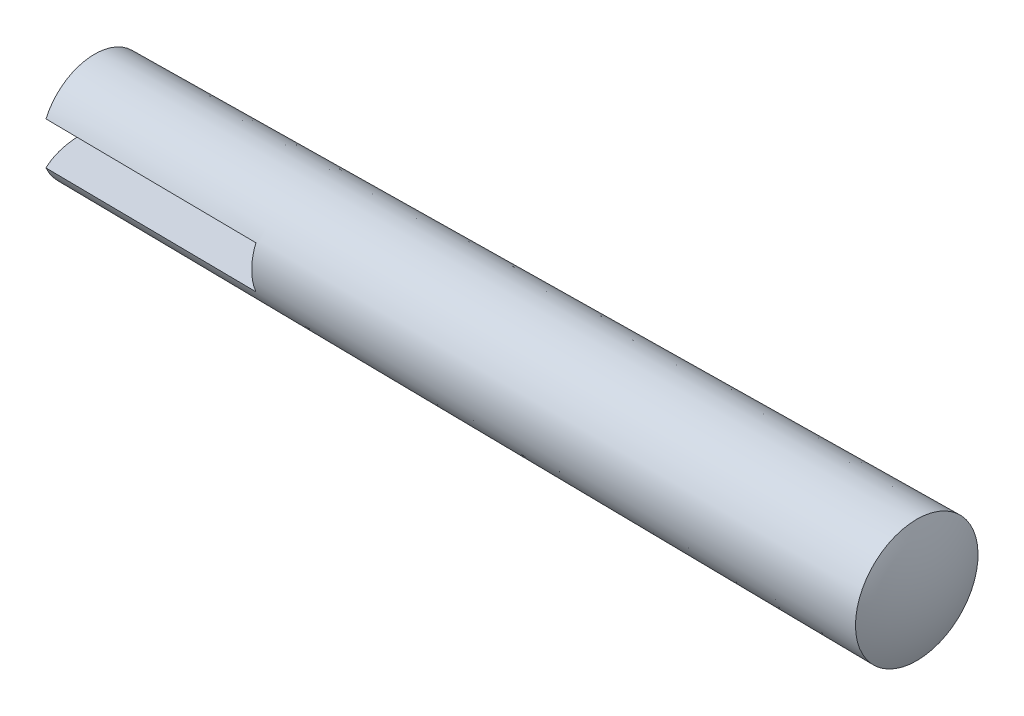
from build123d import *

# Parameters (mm, degrees)
SPLSKE_W      = 5.7748
SPLSKE_H      = 2
SPLIT_2_DEPTH = 30.65250508


with BuildPart() as part:
    # BodySke → Body (revolve)
    with BuildSketch(Plane.XY):
        with BuildLine():
            Line((0.63, 2.5), (39.37, 2.8874))
            ThreePointArc((39.37, 2.8874), (39.840668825, 1.477665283), (40, 0))
            Line((40, 0), (0, 0))
            ThreePointArc((0, 0), (0.159924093, 1.289079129), (0.63, 2.5))
        make_face()
    revolve(axis=Axis((0, 0, 0), (1, 0, 0)))

    # SplSke → Split 2 (cut, through all)
    with BuildSketch(Plane(origin=(10.63, 0, 0), x_dir=(0, 0, -1), z_dir=(1, 0, 0))):
        Rectangle(SPLSKE_W, SPLSKE_H)
    extrude(amount=-SPLIT_2_DEPTH, mode=Mode.SUBTRACT)


solid = part.part
